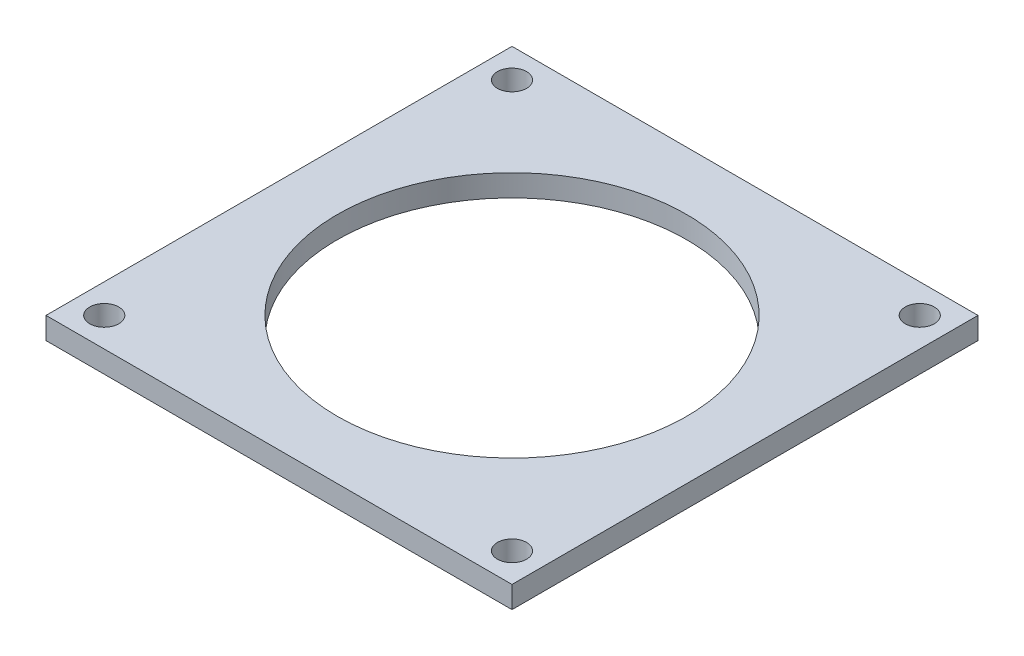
from build123d import *

# Parameters (mm, degrees)
SKETCH1_W           = 101.6
SKETCH1_H           = 101.6
BOSS_EXTRUDE1_DEPTH = 4.7625
SKETCH2_R           = 3.175
SKETCH2_R_2         = 38.1
CUT_EXTRUDE1_DEPTH  = 72.999731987


with BuildPart() as part:
    # Sketch1 → Boss-Extrude1 (new body)
    with BuildSketch(Plane(origin=(0, 0, 0), x_dir=(1, 0, 0), z_dir=(0, 1, 0))):
        Rectangle(SKETCH1_W, SKETCH1_H)
    extrude(amount=BOSS_EXTRUDE1_DEPTH)

    # Sketch2 → Cut-Extrude1 (cut, through all)
    with BuildSketch(Plane(origin=(0, 4.7625, 0), x_dir=(1, 0, 0), z_dir=(0, 1, 0))):
        with Locations(Location((-44.45, 44.45, 0), (0, 0, 270))):
            Circle(SKETCH2_R)
        with Locations(Location((44.45, 44.45, 0), (0, 0, 270))):
            Circle(SKETCH2_R)
        with Locations(Location((44.45, -44.45, 0), (0, 0, 270))):
            Circle(SKETCH2_R)
        with Locations(Location((-44.45, -44.45, 0), (0, 0, 270))):
            Circle(SKETCH2_R)
        with Locations(Location((0, 0, 0), (0, 0, 270))):
            Circle(SKETCH2_R_2)
    extrude(amount=-CUT_EXTRUDE1_DEPTH, mode=Mode.SUBTRACT)


solid = part.part
